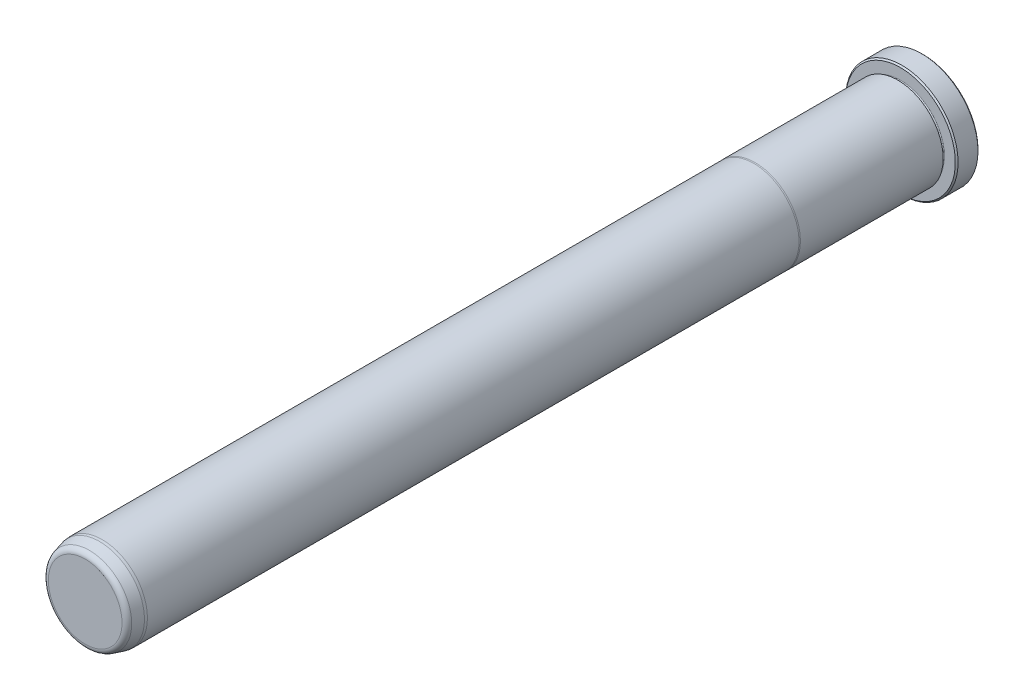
from build123d import *

# Parameters (mm, degrees)
FILLET6_R     = 1.5875
CHAMFER1_SIZE = 0.381


with BuildPart() as part:
    # Sketch1 → Revolve1 (revolve)
    with BuildSketch(Plane(origin=(0, 0, 0), x_dir=(0, 0, -1), z_dir=(1, 0, 0)), mode=Mode.PRIVATE) as revolve1_sk:
        with BuildLine():
            Line((0, 0), (0, 15.748))
            Line((0, 15.748), (-6.35, 15.748))
            Line((-6.35, 15.748), (-6.35, 12.3063))
            ThreePointArc((-6.35, 12.3063), (-6.731, 11.9253), (-7.112, 12.3063))
            Line((-7.112, 12.3063), (-7.112, 12.7127))
            Line((-7.112, 12.7127), (-47.134763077, 12.7127))
            Line((-47.134763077, 12.7127), (-47.498, 12.6873))
            Line((-47.498, 12.6873), (-230.1875, 12.6873))
            Line((-230.1875, 12.6873), (-230.9495, 12.620633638))
            Line((-230.9495, 12.620633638), (-234.95, 11.548702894))
            Line((-234.95, 11.548702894), (-234.95, 0))
            Line((-234.95, 0), (0, 0))
        make_face()
    revolve(revolve1_sk.sketch.rotate(Axis((0, 0, 0), (0, 0, -1)), 90), axis=Axis((0, 0, 0), (0, 0, -1)))

    # Fillet6
    fillet6_edges = [part.edges().sort_by_distance(p)[0] for p in [
        (-11.548702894, 0, 234.95),
    ]]
    fillet(fillet6_edges, radius=FILLET6_R)

    # Chamfer1
    chamfer1_edges = [part.edges().sort_by_distance(p)[0] for p in [
        (-15.748, 0, 6.35),
        (-15.748, 0, 0),
    ]]
    chamfer(chamfer1_edges, length=CHAMFER1_SIZE)


solid = part.part
